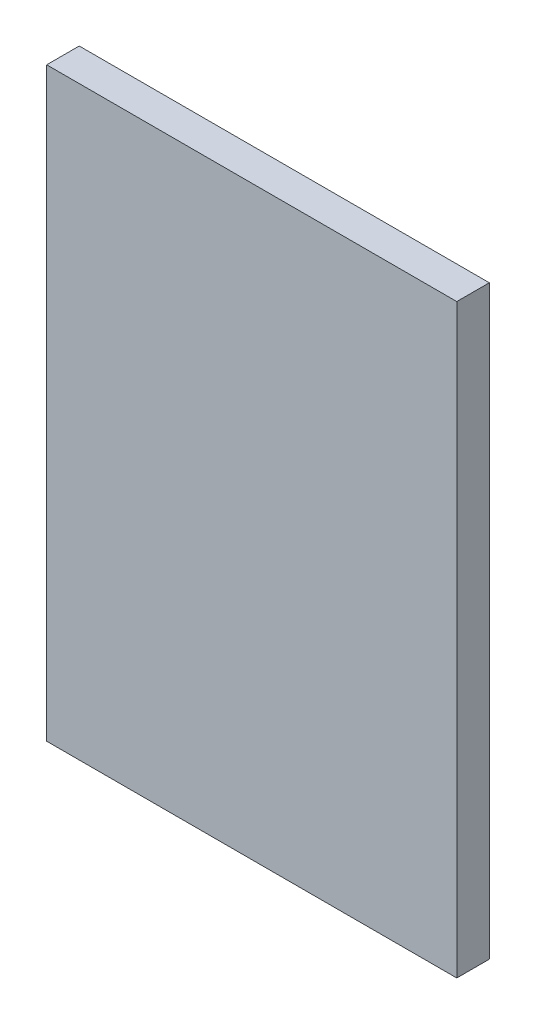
ISO-10303-21;
HEADER;
FILE_DESCRIPTION(('STEP AP214'),'2;1');
FILE_NAME('part.step','',(''),(''),'','','');
FILE_SCHEMA(('AUTOMOTIVE_DESIGN { 1 0 10303 214 1 1 1 1 }'));
ENDSEC;
DATA;
#1=APPLICATION_CONTEXT('core data for automotive mechanical design processes');
#2=APPLICATION_PROTOCOL_DEFINITION('international standard','automotive_design',2000,#1);
#3=PRODUCT_CONTEXT('',#1,'mechanical');
#4=PRODUCT('Part','Part','',(#3));
#5=PRODUCT_RELATED_PRODUCT_CATEGORY('part','',(#4));
#6=PRODUCT_DEFINITION_FORMATION('','',#4);
#7=PRODUCT_DEFINITION_CONTEXT('part definition',#1,'design');
#8=PRODUCT_DEFINITION('design','',#6,#7);
#9=PRODUCT_DEFINITION_SHAPE('','',#8);
#10=(LENGTH_UNIT() NAMED_UNIT(*) SI_UNIT(.MILLI.,.METRE.));
#11=(NAMED_UNIT(*) PLANE_ANGLE_UNIT() SI_UNIT($,.RADIAN.));
#12=(NAMED_UNIT(*) SI_UNIT($,.STERADIAN.) SOLID_ANGLE_UNIT());
#13=UNCERTAINTY_MEASURE_WITH_UNIT(LENGTH_MEASURE(1.E-05),#10,'distance_accuracy_value','');
#14=(GEOMETRIC_REPRESENTATION_CONTEXT(3) GLOBAL_UNCERTAINTY_ASSIGNED_CONTEXT((#13)) GLOBAL_UNIT_ASSIGNED_CONTEXT((#10,
#11,#12)) REPRESENTATION_CONTEXT('',''));
#15=CARTESIAN_POINT('',(0.,0.,0.));
#16=DIRECTION('',(0.,0.,1.));
#17=DIRECTION('',(1.,0.,0.));
#18=AXIS2_PLACEMENT_3D('',#15,#16,#17);
#19=CARTESIAN_POINT('',(0.,0.,-100.));
#20=DIRECTION('',(1.,0.,0.));
#21=DIRECTION('',(0.,0.,-1.));
#22=AXIS2_PLACEMENT_3D('',#19,#20,#21);
#23=PLANE('',#22);
#24=DIRECTION('',(0.,1.,0.));
#25=VECTOR('',#24,1.);
#26=CARTESIAN_POINT('',(0.,0.,0.));
#27=LINE('',#26,#25);
#28=CARTESIAN_POINT('',(0.,0.,0.));
#29=VERTEX_POINT('',#28);
#30=CARTESIAN_POINT('',(0.,1800.,0.));
#31=VERTEX_POINT('',#30);
#32=EDGE_CURVE('E97',#29,#31,#27,.T.);
#33=ORIENTED_EDGE('',*,*,#32,.F.);
#34=DIRECTION('',(0.,0.,1.));
#35=VECTOR('',#34,1.);
#36=CARTESIAN_POINT('',(0.,0.,-100.));
#37=LINE('',#36,#35);
#38=CARTESIAN_POINT('',(0.,0.,-100.));
#39=VERTEX_POINT('',#38);
#40=EDGE_CURVE('E11',#39,#29,#37,.T.);
#41=ORIENTED_EDGE('',*,*,#40,.F.);
#42=DIRECTION('',(0.,1.,0.));
#43=VECTOR('',#42,1.);
#44=CARTESIAN_POINT('',(0.,0.,-100.));
#45=LINE('',#44,#43);
#46=CARTESIAN_POINT('',(0.,1800.,-100.));
#47=VERTEX_POINT('',#46);
#48=EDGE_CURVE('E91',#39,#47,#45,.T.);
#49=ORIENTED_EDGE('',*,*,#48,.T.);
#50=DIRECTION('',(0.,0.,1.));
#51=VECTOR('',#50,1.);
#52=CARTESIAN_POINT('',(0.,1800.,-100.));
#53=LINE('',#52,#51);
#54=EDGE_CURVE('E36',#47,#31,#53,.T.);
#55=ORIENTED_EDGE('',*,*,#54,.T.);
#56=EDGE_LOOP('',(#33,#41,#49,#55));
#57=FACE_BOUND('',#56,.T.);
#58=ADVANCED_FACE('F33',(#57),#23,.T.);
#59=CARTESIAN_POINT('',(0.,0.,-100.));
#60=DIRECTION('',(0.,-1.,0.));
#61=DIRECTION('',(1.,0.,0.));
#62=AXIS2_PLACEMENT_3D('',#59,#60,#61);
#63=PLANE('',#62);
#64=DIRECTION('',(1.,0.,0.));
#65=VECTOR('',#64,1.);
#66=CARTESIAN_POINT('',(0.,0.,0.));
#67=LINE('',#66,#65);
#68=CARTESIAN_POINT('',(-1260.,-1.54305496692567E-13,0.));
#69=VERTEX_POINT('',#68);
#70=EDGE_CURVE('E93',#69,#29,#67,.T.);
#71=ORIENTED_EDGE('',*,*,#70,.F.);
#72=DIRECTION('',(0.,0.,1.));
#73=VECTOR('',#72,1.);
#74=CARTESIAN_POINT('',(-1260.,-1.54305496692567E-13,-100.));
#75=LINE('',#74,#73);
#76=CARTESIAN_POINT('',(-1260.,-1.54305496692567E-13,-100.));
#77=VERTEX_POINT('',#76);
#78=EDGE_CURVE('E42',#77,#69,#75,.T.);
#79=ORIENTED_EDGE('',*,*,#78,.F.);
#80=DIRECTION('',(1.,0.,0.));
#81=VECTOR('',#80,1.);
#82=CARTESIAN_POINT('',(0.,0.,-100.));
#83=LINE('',#82,#81);
#84=EDGE_CURVE('E88',#77,#39,#83,.T.);
#85=ORIENTED_EDGE('',*,*,#84,.T.);
#86=ORIENTED_EDGE('',*,*,#40,.T.);
#87=EDGE_LOOP('',(#71,#79,#85,#86));
#88=FACE_BOUND('',#87,.T.);
#89=ADVANCED_FACE('F107',(#88),#63,.T.);
#90=CARTESIAN_POINT('',(-1260.,-1.54305496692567E-13,-100.));
#91=DIRECTION('',(-1.,0.,0.));
#92=DIRECTION('',(0.,0.,1.));
#93=AXIS2_PLACEMENT_3D('',#90,#91,#92);
#94=PLANE('',#93);
#95=DIRECTION('',(0.,-1.,0.));
#96=VECTOR('',#95,1.);
#97=CARTESIAN_POINT('',(-1260.,-1.54305496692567E-13,0.));
#98=LINE('',#97,#96);
#99=CARTESIAN_POINT('',(-1260.,1800.,0.));
#100=VERTEX_POINT('',#99);
#101=EDGE_CURVE('E83',#100,#69,#98,.T.);
#102=ORIENTED_EDGE('',*,*,#101,.F.);
#103=DIRECTION('',(0.,0.,1.));
#104=VECTOR('',#103,1.);
#105=CARTESIAN_POINT('',(-1260.,1800.,-100.));
#106=LINE('',#105,#104);
#107=CARTESIAN_POINT('',(-1260.,1800.,-100.));
#108=VERTEX_POINT('',#107);
#109=EDGE_CURVE('E78',#108,#100,#106,.T.);
#110=ORIENTED_EDGE('',*,*,#109,.F.);
#111=DIRECTION('',(0.,-1.,0.));
#112=VECTOR('',#111,1.);
#113=CARTESIAN_POINT('',(-1260.,-1.54305496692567E-13,-100.));
#114=LINE('',#113,#112);
#115=EDGE_CURVE('E81',#108,#77,#114,.T.);
#116=ORIENTED_EDGE('',*,*,#115,.T.);
#117=ORIENTED_EDGE('',*,*,#78,.T.);
#118=EDGE_LOOP('',(#102,#110,#116,#117));
#119=FACE_BOUND('',#118,.T.);
#120=ADVANCED_FACE('F80',(#119),#94,.T.);
#121=CARTESIAN_POINT('',(0.,1800.,-100.));
#122=DIRECTION('',(0.,1.,0.));
#123=DIRECTION('',(-1.,0.,0.));
#124=AXIS2_PLACEMENT_3D('',#121,#122,#123);
#125=PLANE('',#124);
#126=DIRECTION('',(-1.,0.,0.));
#127=VECTOR('',#126,1.);
#128=CARTESIAN_POINT('',(0.,1800.,0.));
#129=LINE('',#128,#127);
#130=EDGE_CURVE('E100',#31,#100,#129,.T.);
#131=ORIENTED_EDGE('',*,*,#130,.F.);
#132=ORIENTED_EDGE('',*,*,#54,.F.);
#133=DIRECTION('',(-1.,0.,0.));
#134=VECTOR('',#133,1.);
#135=CARTESIAN_POINT('',(0.,1800.,-100.));
#136=LINE('',#135,#134);
#137=EDGE_CURVE('E87',#47,#108,#136,.T.);
#138=ORIENTED_EDGE('',*,*,#137,.T.);
#139=ORIENTED_EDGE('',*,*,#109,.T.);
#140=EDGE_LOOP('',(#131,#132,#138,#139));
#141=FACE_BOUND('',#140,.T.);
#142=ADVANCED_FACE('F90',(#141),#125,.T.);
#143=CARTESIAN_POINT('',(0.,0.,-100.));
#144=DIRECTION('',(0.,0.,1.));
#145=DIRECTION('',(1.,0.,0.));
#146=AXIS2_PLACEMENT_3D('',#143,#144,#145);
#147=PLANE('',#146);
#148=ORIENTED_EDGE('',*,*,#48,.F.);
#149=ORIENTED_EDGE('',*,*,#84,.F.);
#150=ORIENTED_EDGE('',*,*,#115,.F.);
#151=ORIENTED_EDGE('',*,*,#137,.F.);
#152=EDGE_LOOP('',(#148,#149,#150,#151));
#153=FACE_BOUND('',#152,.T.);
#154=ADVANCED_FACE('F86',(#153),#147,.F.);
#155=CARTESIAN_POINT('',(0.,0.,0.));
#156=DIRECTION('',(0.,0.,1.));
#157=DIRECTION('',(1.,0.,0.));
#158=AXIS2_PLACEMENT_3D('',#155,#156,#157);
#159=PLANE('',#158);
#160=ORIENTED_EDGE('',*,*,#32,.T.);
#161=ORIENTED_EDGE('',*,*,#130,.T.);
#162=ORIENTED_EDGE('',*,*,#101,.T.);
#163=ORIENTED_EDGE('',*,*,#70,.T.);
#164=EDGE_LOOP('',(#160,#161,#162,#163));
#165=FACE_BOUND('',#164,.T.);
#166=ADVANCED_FACE('F106',(#165),#159,.T.);
#167=CLOSED_SHELL('',(#58,#89,#120,#142,#154,#166));
#168=MANIFOLD_SOLID_BREP('B2',#167);
#169=ADVANCED_BREP_SHAPE_REPRESENTATION('',(#18,#168),#14);
#170=SHAPE_DEFINITION_REPRESENTATION(#9,#169);
ENDSEC;
END-ISO-10303-21;
